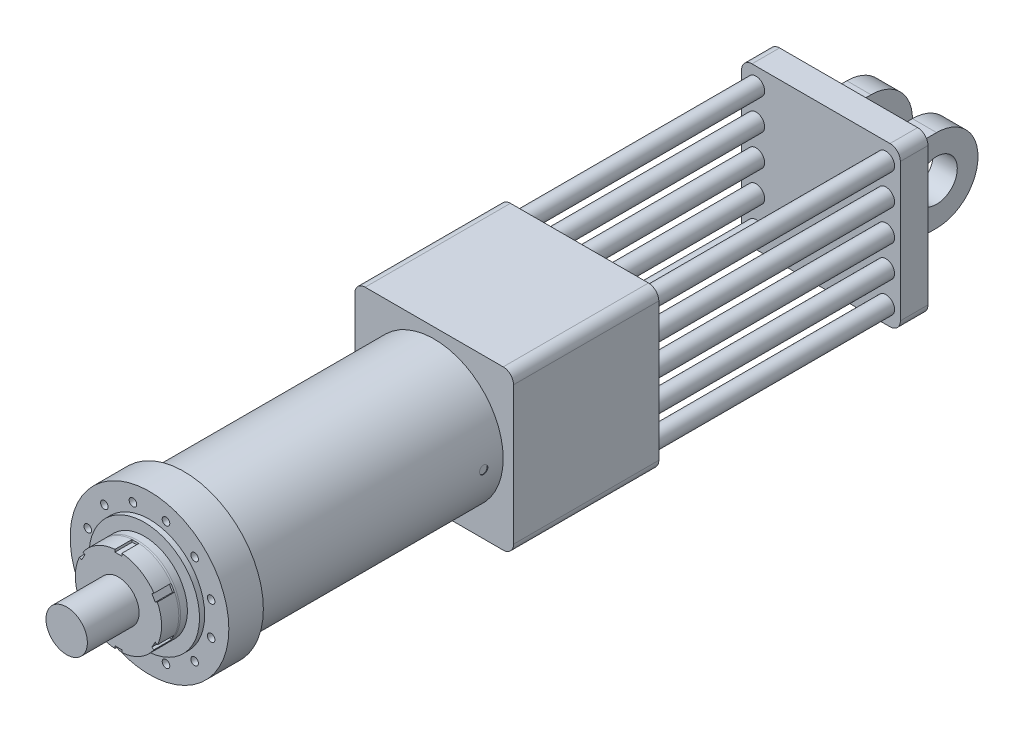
from build123d import *

# Parameters (mm, degrees)
SKETCH_1_R          = 200
EXTRUDE_1_DEPTH     = 725
SKETCH_2_R          = 230
SKETCH_2_R_2        = 11
EXTRUDE_2_DEPTH     = 100
SKETCH_3_R          = 160
EXTRUDE_3_DEPTH     = 15
SKETCH_4_R          = 125
EXTRUDE_4_DEPTH     = 25
CHAMFER_1_SIZE      = 5
CHAMFER_1_SIZE2     = 0.881634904
SKETCH_6_W          = 460
SKETCH_6_H          = 460
EXTRUDE_6_DEPTH     = 421
SKETCH_9_R          = 12
CUT_EXTRUDE_2_DEPTH = 2
SKETCH_10_R         = 12
CUT_EXTRUDE_3_DEPTH = 2
EXTRUDE_7_DEPTH     = 50
SKETCH_11_R         = 60
EXTRUDE_8_DEPTH     = 150
SKETCH_12_R         = 25
EXTRUDE_9_DEPTH     = 700
SKETCH_13_W         = 460
SKETCH_13_H         = 460
EXTRUDE_10_DEPTH    = 80
FILLET_1_R          = 30
SKETCH_14_W         = 70
SKETCH_14_H         = 240
EXTRUDE_11_DEPTH    = 245
SKETCH_15_R         = 60
CUT_EXTRUDE_4_DEPTH = 260
CHAMFER_2_SIZE      = 20


with BuildPart() as part:
    # Sketch 1 → Extrude 1 (new body)
    with BuildSketch(Plane.XY):
        Circle(SKETCH_1_R)
    extrude(amount=EXTRUDE_1_DEPTH)

    # Sketch 2 → Extrude 2 (add)
    with BuildSketch(Plane.XY.offset(725)):
        Circle(SKETCH_2_R)
        with Locations((178.696277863, 47.881523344)):
            Circle(SKETCH_2_R_2, mode=Mode.SUBTRACT)
        with Locations((178.696277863, -47.881523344)):
            Circle(SKETCH_2_R_2, mode=Mode.SUBTRACT)
        with Locations((130.81475452, -130.81475452)):
            Circle(SKETCH_2_R_2, mode=Mode.SUBTRACT)
        with Locations((47.881523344, -178.696277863)):
            Circle(SKETCH_2_R_2, mode=Mode.SUBTRACT)
        with Locations((-47.881523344, -178.696277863)):
            Circle(SKETCH_2_R_2, mode=Mode.SUBTRACT)
        with Locations((-130.81475452, -130.81475452)):
            Circle(SKETCH_2_R_2, mode=Mode.SUBTRACT)
        with Locations((-178.696277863, -47.881523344)):
            Circle(SKETCH_2_R_2, mode=Mode.SUBTRACT)
        with Locations((-178.696277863, 47.881523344)):
            Circle(SKETCH_2_R_2, mode=Mode.SUBTRACT)
        with Locations((-130.81475452, 130.814754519)):
            Circle(SKETCH_2_R_2, mode=Mode.SUBTRACT)
        with Locations((-47.881523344, 178.696277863)):
            Circle(SKETCH_2_R_2, mode=Mode.SUBTRACT)
        with Locations((47.881523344, 178.696277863)):
            Circle(SKETCH_2_R_2, mode=Mode.SUBTRACT)
        with Locations((130.81475452, 130.81475452)):
            Circle(SKETCH_2_R_2, mode=Mode.SUBTRACT)
    extrude(amount=EXTRUDE_2_DEPTH)

    # Sketch 3 → Extrude 3 (add)
    with BuildSketch(Plane.XY.offset(825)):
        Circle(SKETCH_3_R)
    extrude(amount=EXTRUDE_3_DEPTH)

    # Sketch 4 → Extrude 4 (add)
    with BuildSketch(Plane.XY.offset(840)):
        Circle(SKETCH_4_R)
    extrude(amount=EXTRUDE_4_DEPTH)

    # Chamfer 1
    chamfer_1_edges = [part.edges().sort_by_distance(p)[0] for p in [
        (-125, 0, 865),
    ]]
    chamfer_1_side = [part.faces().sort_by_distance(p)[0] for p in [
        (-125, 0, 852.5),
    ]]
    chamfer(chamfer_1_edges, length=CHAMFER_1_SIZE, length2=CHAMFER_1_SIZE2, reference=chamfer_1_side[0])

    # Sketch 6 → Extrude 6 (add)
    with BuildSketch(Plane(origin=(0, 0, 0), x_dir=(-1, 0, 0), z_dir=(0, 0, -1))):
        Rectangle(SKETCH_6_W, SKETCH_6_H)
    extrude(amount=EXTRUDE_6_DEPTH)

    # Sketch 9 → Cut-Extrude 2 (cut)
    with BuildSketch(Plane(origin=(-200, 0, 0), x_dir=(0, 0, -1), z_dir=(1, 0, 0))):
        with Locations(Location((-36.5, 0, 0), (0, 0, 180))):
            Circle(SKETCH_9_R)
        with Locations(Location((-670.5, 0, 0), (0, 0, 180))):
            Circle(SKETCH_9_R)
    extrude(amount=CUT_EXTRUDE_2_DEPTH, mode=Mode.SUBTRACT)

    # Sketch 10 → Cut-Extrude 3 (cut)
    with BuildSketch(Plane(origin=(200, 0, 0), x_dir=(0, 0, -1), z_dir=(1, 0, 0))):
        with Locations((-56.5, 0)):
            Circle(SKETCH_10_R)
    extrude(amount=-CUT_EXTRUDE_3_DEPTH, mode=Mode.SUBTRACT)

    # Sketch 5 → Extrude 7 (add)
    with BuildSketch(Plane.XY.offset(865)):
        with BuildLine():
            Line((-10, 124.599357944), (-10, 117.5))
            Line((-10, 117.5), (10, 117.5))
            Line((10, 117.5), (10, 124.599357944))
            ThreePointArc((10, 124.599357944), (62.5, 108.253175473), (102.906209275, 70.95993301))
            Line((102.906209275, 70.95993301), (96.757984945, 67.410254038))
            Line((96.757984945, 67.410254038), (106.757984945, 50.089745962))
            Line((106.757984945, 50.089745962), (112.906209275, 53.639424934))
            ThreePointArc((112.906209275, 53.639424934), (125, 0), (112.906209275, -53.639424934))
            Line((112.906209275, -53.639424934), (106.757984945, -50.089745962))
            Line((106.757984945, -50.089745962), (96.757984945, -67.410254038))
            Line((96.757984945, -67.410254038), (102.906209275, -70.95993301))
            ThreePointArc((102.906209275, -70.95993301), (62.5, -108.253175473), (10, -124.599357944))
            Line((10, -124.599357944), (10, -117.5))
            Line((10, -117.5), (-10, -117.5))
            Line((-10, -117.5), (-10, -124.599357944))
            ThreePointArc((-10, -124.599357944), (-62.5, -108.253175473), (-102.906209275, -70.95993301))
            Line((-102.906209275, -70.95993301), (-96.757984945, -67.410254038))
            Line((-96.757984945, -67.410254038), (-106.757984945, -50.089745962))
            Line((-106.757984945, -50.089745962), (-112.906209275, -53.639424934))
            ThreePointArc((-112.906209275, -53.639424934), (-125, 0), (-112.906209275, 53.639424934))
            Line((-112.906209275, 53.639424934), (-106.757984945, 50.089745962))
            Line((-106.757984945, 50.089745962), (-96.757984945, 67.410254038))
            Line((-96.757984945, 67.410254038), (-102.906209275, 70.95993301))
            ThreePointArc((-102.906209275, 70.95993301), (-62.5, 108.253175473), (-10, 124.599357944))
        make_face()
    extrude(amount=EXTRUDE_7_DEPTH)

    # Sketch 11 → Extrude 8 (add)
    with BuildSketch(Plane.XY.offset(915)):
        Circle(SKETCH_11_R)
    extrude(amount=EXTRUDE_8_DEPTH)

    # Sketch 12 → Extrude 9 (add)
    with BuildSketch(Plane(origin=(0, 0, -421), x_dir=(-1, 0, 0), z_dir=(0, 0, -1))):
        with Locations((-188.269799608, 180)):
            Circle(SKETCH_12_R)
        with Locations((-188.269799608, 90)):
            Circle(SKETCH_12_R)
        with Locations((-188.269799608, 0)):
            Circle(SKETCH_12_R)
        with Locations((-188.269799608, -90)):
            Circle(SKETCH_12_R)
        with Locations((-188.269799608, -180)):
            Circle(SKETCH_12_R)
        with Locations(Location((188.269799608, -180, 0), (0, 0, 180))):
            Circle(SKETCH_12_R)
        with Locations(Location((188.269799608, -90, 0), (0, 0, 180))):
            Circle(SKETCH_12_R)
        with Locations(Location((188.269799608, 0, 0), (0, 0, 180))):
            Circle(SKETCH_12_R)
        with Locations(Location((188.269799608, 90, 0), (0, 0, 180))):
            Circle(SKETCH_12_R)
        with Locations(Location((188.269799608, 180, 0), (0, 0, 180))):
            Circle(SKETCH_12_R)
    extrude(amount=EXTRUDE_9_DEPTH)

    # Sketch 13 → Extrude 10 (add)
    with BuildSketch(Plane(origin=(0, 0, -1121), x_dir=(-1, 0, 0), z_dir=(0, 0, -1))):
        Rectangle(SKETCH_13_W, SKETCH_13_H)
    extrude(amount=EXTRUDE_10_DEPTH)

    # Fillet 1
    fillet_1_edges = [part.edges().sort_by_distance(p)[0] for p in [
        (-230, -230, -1161),
        (-230, 230, -1161),
        (230, 230, -1161),
        (230, -230, -1161),
        (-230, -230, -210.5),
        (-230, 230, -210.5),
        (230, 230, -210.5),
        (230, -230, -210.5),
    ]]
    fillet(fillet_1_edges, radius=FILLET_1_R)

    # Sketch 14 → Extrude 11 (add)
    with BuildSketch(Plane(origin=(0, 0, -1201), x_dir=(-1, 0, 0), z_dir=(0, 0, -1))):
        with Locations((-95, 0)):
            Rectangle(SKETCH_14_W, SKETCH_14_H)
        with Locations((95, 0)):
            Rectangle(SKETCH_14_W, SKETCH_14_H)
    extrude(amount=EXTRUDE_11_DEPTH)

    # Sketch 15 → Cut-Extrude 4 (cut)
    with BuildSketch(Plane.ZY.offset(130)):
        with Locations(Location((-1326, 0, 0), (0, 0, 270))):
            Circle(SKETCH_15_R)
        with BuildLine():
            Line((-1326, 120), (-1551.855465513, 168.072267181))
            Line((-1551.855465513, 168.072267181), (-1541.326267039, -184.304908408))
            Line((-1541.326267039, -184.304908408), (-1326, -120))
            ThreePointArc((-1326, -120), (-1446, 0), (-1326, 120))
        make_face()
    extrude(amount=-CUT_EXTRUDE_4_DEPTH, mode=Mode.SUBTRACT)

    # Chamfer 2
    chamfer_2_edges = [part.edges().sort_by_distance(p)[0] for p in [
        (60, 0, -1201),
        (95, 120, -1201),
        (130, 0, -1201),
        (95, -120, -1201),
        (-130, 0, -1201),
        (-95, 120, -1201),
        (-95, -120, -1201),
    ]]
    chamfer(chamfer_2_edges, length=CHAMFER_2_SIZE)


solid = part.part
